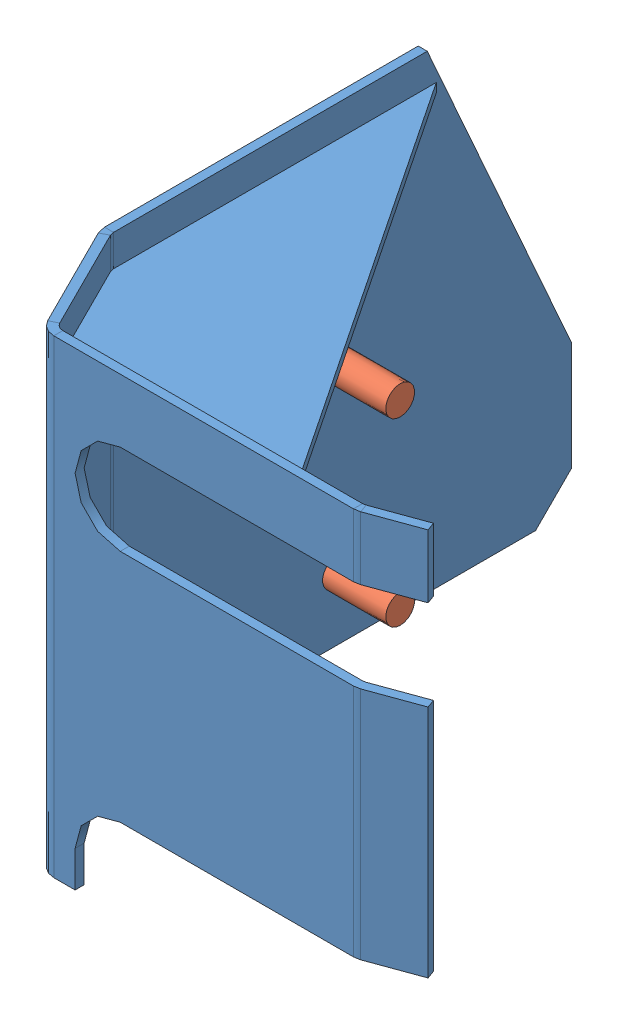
SolidWorks assembly CP036144.sldasm, configuration Défaut (file format 8000). Lengths in mm.
Overall size (117.45 130 160).
3 component instances, 2 part files, 5 mates.
Components (placement in the parent):
- CP036145-1: CP036145.sldprt [Défaut] at origin size (117.45 130 160)
- 6003 (20)-1: 6003 (20).sldprt [30] at (-2.5 17.5 65) x (0 1 0) z (1 0 0) size (8 8 20)
- 6003 (20)-2: 6003 (20).sldprt [30] at (-2.5 67.5 65) x (0 1 0) z (1 0 0) size (8 8 20)
Mates (geometry in assembly coordinates):
- Coaxiale1: concentric anti-aligned: cylinder of CP036145-1 through (0 17.5 65) axis (1 0 0) radius 3.4; cylinder of 6003 (20)-1 through (17.5 17.5 65) axis (-1 0 0) radius 4
- Coïncidente1: coincident aligned: plane of CP036145-1 through (-2.5 130 127.5) normal (-1 0 0); plane of 6003 (20)-1 through (-2.5 17.5 65) normal (-1 0 0)
- Coaxiale2: concentric anti-aligned: cylinder of CP036145-1 through (0 67.5 65) axis (1 0 0) radius 3.4; cylinder of 6003 (20)-2 through (17.5 67.5 65) axis (-1 0 0) radius 4
- Coïncidente2: coincident aligned: plane of CP036145-1 through (-2.5 130 127.5) normal (-1 0 0); plane of 6003 (20)-2 through (-2.5 67.5 65) normal (-1 0 0)
- Coïncidente3: coincident aligned: plane of 6003 (20)-1; plane of 6003 (20)-2
